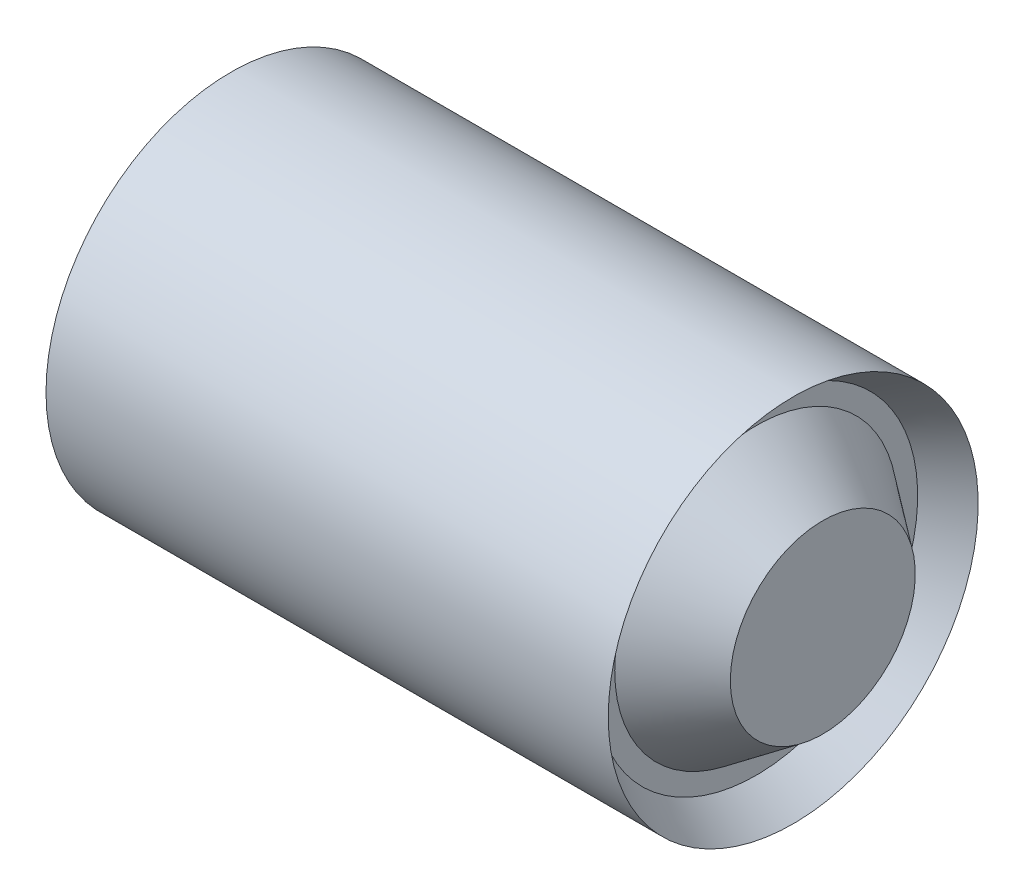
from build123d import *


with BuildPart() as part:
    # Sketch 1 → Revolve 1 (revolve)
    with BuildSketch(Plane.XY, mode=Mode.PRIVATE) as revolve_1_sk:
        Polygon((-21, 0), (-21, 6.25), (-16.5, 9.5625), (-16.5, 10.911016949), (-19, 12.5), (19, 12.5), (16.5, 10.911016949), (16.5, 9.5625), (21, 6.25), (21, 0), align=None)
    revolve(revolve_1_sk.sketch.rotate(Axis((21, 0, 0), (-1, 0, 0)), 270), axis=Axis((21, 0, 0), (-1, 0, 0)))


solid = part.part
